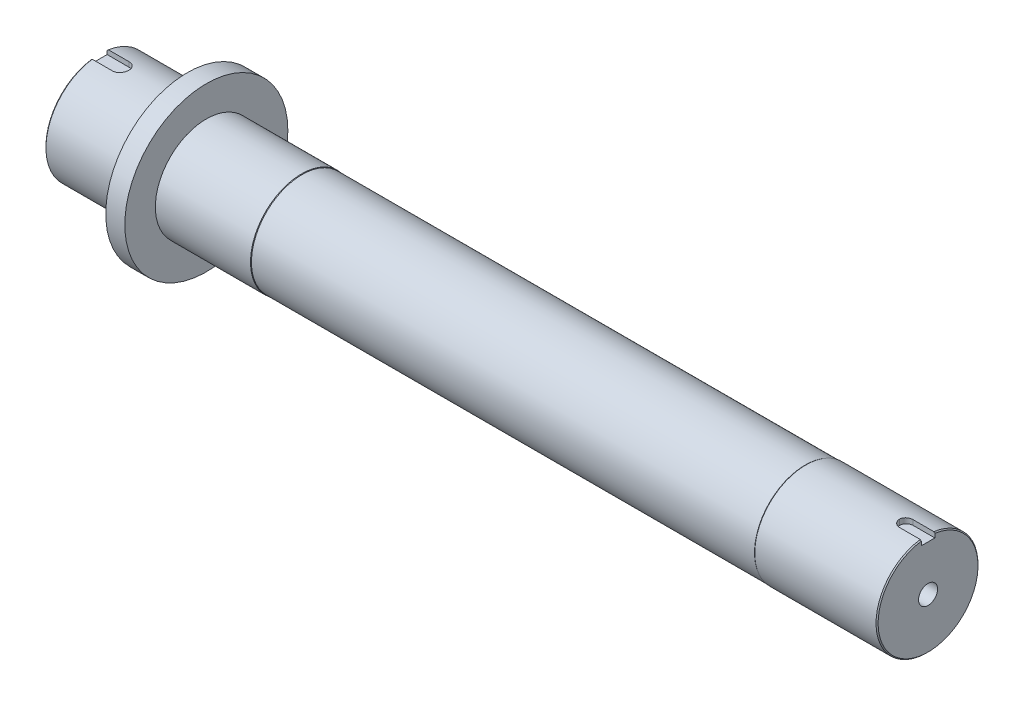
ISO-10303-21;
HEADER;
FILE_DESCRIPTION(('STEP AP214'),'2;1');
FILE_NAME('part.step','',(''),(''),'','','');
FILE_SCHEMA(('AUTOMOTIVE_DESIGN { 1 0 10303 214 1 1 1 1 }'));
ENDSEC;
DATA;
#1=APPLICATION_CONTEXT('core data for automotive mechanical design processes');
#2=APPLICATION_PROTOCOL_DEFINITION('international standard','automotive_design',2000,#1);
#3=PRODUCT_CONTEXT('',#1,'mechanical');
#4=PRODUCT('Part','Part','',(#3));
#5=PRODUCT_RELATED_PRODUCT_CATEGORY('part','',(#4));
#6=PRODUCT_DEFINITION_FORMATION('','',#4);
#7=PRODUCT_DEFINITION_CONTEXT('part definition',#1,'design');
#8=PRODUCT_DEFINITION('design','',#6,#7);
#9=PRODUCT_DEFINITION_SHAPE('','',#8);
#10=(LENGTH_UNIT() NAMED_UNIT(*) SI_UNIT(.MILLI.,.METRE.));
#11=(NAMED_UNIT(*) PLANE_ANGLE_UNIT() SI_UNIT($,.RADIAN.));
#12=(NAMED_UNIT(*) SI_UNIT($,.STERADIAN.) SOLID_ANGLE_UNIT());
#13=UNCERTAINTY_MEASURE_WITH_UNIT(LENGTH_MEASURE(1.E-05),#10,'distance_accuracy_value','');
#14=(GEOMETRIC_REPRESENTATION_CONTEXT(3) GLOBAL_UNCERTAINTY_ASSIGNED_CONTEXT((#13)) GLOBAL_UNIT_ASSIGNED_CONTEXT((#10,
#11,#12)) REPRESENTATION_CONTEXT('',''));
#15=CARTESIAN_POINT('',(0.,0.,0.));
#16=DIRECTION('',(0.,0.,1.));
#17=DIRECTION('',(1.,0.,0.));
#18=AXIS2_PLACEMENT_3D('',#15,#16,#17);
#19=CARTESIAN_POINT('',(0.,40.,0.));
#20=DIRECTION('',(-1.,0.,0.));
#21=DIRECTION('',(0.,0.,1.));
#22=AXIS2_PLACEMENT_3D('',#19,#20,#21);
#23=PLANE('',#22);
#24=DIRECTION('',(0.,-1.,0.));
#25=VECTOR('',#24,1.);
#26=CARTESIAN_POINT('',(0.,40.,-6.00000000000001));
#27=LINE('',#26,#25);
#28=CARTESIAN_POINT('',(0.,38.5356977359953,-6.00000000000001));
#29=VERTEX_POINT('',#28);
#30=CARTESIAN_POINT('',(0.,36.,-6.00000000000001));
#31=VERTEX_POINT('',#30);
#32=EDGE_CURVE('E148',#29,#31,#27,.T.);
#33=ORIENTED_EDGE('',*,*,#32,.F.);
#34=CARTESIAN_POINT('',(0.,0.,0.));
#35=DIRECTION('',(-1.,0.,0.));
#36=DIRECTION('',(0.,0.,1.));
#37=AXIS2_PLACEMENT_3D('',#34,#35,#36);
#38=CIRCLE('',#37,38.9999999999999);
#39=CARTESIAN_POINT('',(0.,38.5356977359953,6.00000000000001));
#40=VERTEX_POINT('',#39);
#41=EDGE_CURVE('E50',#29,#40,#38,.T.);
#42=ORIENTED_EDGE('',*,*,#41,.T.);
#43=DIRECTION('',(0.,1.,0.));
#44=VECTOR('',#43,1.);
#45=CARTESIAN_POINT('',(0.,40.,6.00000000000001));
#46=LINE('',#45,#44);
#47=CARTESIAN_POINT('',(0.,36.,6.00000000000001));
#48=VERTEX_POINT('',#47);
#49=EDGE_CURVE('E153',#48,#40,#46,.T.);
#50=ORIENTED_EDGE('',*,*,#49,.F.);
#51=DIRECTION('',(0.,0.,1.));
#52=VECTOR('',#51,1.);
#53=CARTESIAN_POINT('',(0.,36.,-6.00000000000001));
#54=LINE('',#53,#52);
#55=EDGE_CURVE('E150',#31,#48,#54,.T.);
#56=ORIENTED_EDGE('',*,*,#55,.F.);
#57=EDGE_LOOP('',(#33,#42,#50,#56));
#58=FACE_BOUND('',#57,.T.);
#59=ADVANCED_FACE('F38',(#58),#23,.T.);
#60=CARTESIAN_POINT('',(0.,0.,0.));
#61=DIRECTION('',(1.,0.,0.));
#62=DIRECTION('',(0.,0.,-1.));
#63=AXIS2_PLACEMENT_3D('',#60,#61,#62);
#64=CYLINDRICAL_SURFACE('',#63,40.);
#65=DIRECTION('',(1.,0.,0.));
#66=VECTOR('',#65,1.);
#67=CARTESIAN_POINT('',(0.,39.5474398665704,6.00000000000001));
#68=LINE('',#67,#66);
#69=CARTESIAN_POINT('',(1.00000000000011,39.5474398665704,6.00000000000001));
#70=VERTEX_POINT('',#69);
#71=CARTESIAN_POINT('',(16.,39.5474398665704,6.00000000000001));
#72=VERTEX_POINT('',#71);
#73=EDGE_CURVE('E365',#70,#72,#68,.T.);
#74=ORIENTED_EDGE('',*,*,#73,.F.);
#75=CARTESIAN_POINT('',(1.00000000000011,0.,0.));
#76=DIRECTION('',(-1.,0.,0.));
#77=DIRECTION('',(0.,0.,1.));
#78=AXIS2_PLACEMENT_3D('',#75,#76,#77);
#79=CIRCLE('',#78,40.);
#80=CARTESIAN_POINT('',(1.00000000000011,39.5474398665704,-6.00000000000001));
#81=VERTEX_POINT('',#80);
#82=EDGE_CURVE('E311',#70,#81,#79,.F.);
#83=ORIENTED_EDGE('',*,*,#82,.T.);
#84=DIRECTION('',(1.,0.,0.));
#85=VECTOR('',#84,1.);
#86=CARTESIAN_POINT('',(0.,39.5474398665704,-6.00000000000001));
#87=LINE('',#86,#85);
#88=CARTESIAN_POINT('',(16.,39.5474398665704,-6.00000000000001));
#89=VERTEX_POINT('',#88);
#90=EDGE_CURVE('E370',#89,#81,#87,.F.);
#91=ORIENTED_EDGE('',*,*,#90,.F.);
#92=CARTESIAN_POINT('',(16.,39.5474398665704,-6.00000000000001));
#93=CARTESIAN_POINT('',(16.1677459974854,39.5474288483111,-6.00001919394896));
#94=CARTESIAN_POINT('',(16.3354879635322,39.5485067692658,-5.99296614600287));
#95=CARTESIAN_POINT('',(16.6697528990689,39.5527606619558,-5.96485517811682));
#96=CARTESIAN_POINT('',(16.836275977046,39.555936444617,-5.94379852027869));
#97=CARTESIAN_POINT('',(17.1667210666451,39.5643011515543,-5.88785406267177));
#98=CARTESIAN_POINT('',(17.3306460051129,39.5694876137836,-5.85298317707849));
#99=CARTESIAN_POINT('',(17.6549401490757,39.5817203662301,-5.76967896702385));
#100=CARTESIAN_POINT('',(17.8153093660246,39.5887666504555,-5.72124568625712));
#101=CARTESIAN_POINT('',(18.1313799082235,39.6045181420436,-5.61116993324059));
#102=CARTESIAN_POINT('',(18.2870808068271,39.6132235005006,-5.54952625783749));
#103=CARTESIAN_POINT('',(18.5927731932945,39.6320474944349,-5.41345805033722));
#104=CARTESIAN_POINT('',(18.742762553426,39.642166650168,-5.33902881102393));
#105=CARTESIAN_POINT('',(19.0358834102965,39.663525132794,-5.17796937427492));
#106=CARTESIAN_POINT('',(19.179017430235,39.6747640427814,-5.09134371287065));
#107=CARTESIAN_POINT('',(19.45755833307,39.6980533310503,-4.90644915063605));
#108=CARTESIAN_POINT('',(19.5929624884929,39.7101039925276,-4.80817617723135));
#109=CARTESIAN_POINT('',(19.8559676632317,39.7347609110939,-4.59998203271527));
#110=CARTESIAN_POINT('',(19.9835088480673,39.7473704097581,-4.48998565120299));
#111=CARTESIAN_POINT('',(20.2288907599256,39.7727120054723,-4.25967106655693));
#112=CARTESIAN_POINT('',(20.3467314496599,39.7854441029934,-4.13935282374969));
#113=CARTESIAN_POINT('',(20.5719379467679,39.8106780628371,-3.88917980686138));
#114=CARTESIAN_POINT('',(20.6792999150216,39.8231798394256,-3.75932156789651));
#115=CARTESIAN_POINT('',(20.882714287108,39.8475934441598,-3.491049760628));
#116=CARTESIAN_POINT('',(20.9787706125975,39.8595054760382,-3.35263918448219));
#117=CARTESIAN_POINT('',(21.1594257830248,39.8824723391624,-3.06740557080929));
#118=CARTESIAN_POINT('',(21.2439597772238,39.8935221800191,-2.92054104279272));
#119=CARTESIAN_POINT('',(21.40030861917,39.9143749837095,-2.62017644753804));
#120=CARTESIAN_POINT('',(21.4721281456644,39.9241784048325,-2.46667884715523));
#121=CARTESIAN_POINT('',(21.6025342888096,39.9422610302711,-2.15412757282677));
#122=CARTESIAN_POINT('',(21.6611253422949,39.9505407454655,-1.99507578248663));
#123=CARTESIAN_POINT('',(21.7646494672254,39.9653420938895,-1.67257605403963));
#124=CARTESIAN_POINT('',(21.8095858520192,39.9718641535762,-1.50912919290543));
#125=CARTESIAN_POINT('',(21.8981440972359,39.9848163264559,-1.12378184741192));
#126=CARTESIAN_POINT('',(21.9363286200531,39.9904902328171,-0.900567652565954));
#127=CARTESIAN_POINT('',(21.9745217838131,39.996184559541,-0.563799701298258));
#128=CARTESIAN_POINT('',(21.9840722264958,39.9976132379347,-0.451261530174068));
#129=CARTESIAN_POINT('',(21.9968105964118,39.9995214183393,-0.225825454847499));
#130=CARTESIAN_POINT('',(21.999998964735,40.000000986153,-0.11292757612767));
#131=CARTESIAN_POINT('',(22.,40.,0.));
#132=B_SPLINE_CURVE_WITH_KNOTS('',3,(#92,#93,#94,#95,#96,#97,#98,#99,#100,#101,#102,#103,#104,
#105,#106,#107,#108,#109,#110,#111,#112,#113,#114,#115,#116,#117,#118,#119,#120,#121,#122,#123,
#124,#125,#126,#127,#128,#129,#130,#131),.UNSPECIFIED.,.F.,.F.,(4,2,2,2,2,2,2,2,2,2,2,2,2,2,2,2,
2,2,2,4),(0.,0.503080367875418,1.00611540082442,1.50853641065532,2.01095580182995,
2.51342097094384,3.01607152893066,3.51853563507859,4.0211759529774,4.52726089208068,
5.0333477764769,5.5396193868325,6.04571486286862,6.55455051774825,7.06319853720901,
7.57167570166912,8.08002938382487,8.75793555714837,9.09663656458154,9.4353140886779),.UNSPECIFIED.);
#133=CARTESIAN_POINT('',(22.,40.,0.));
#134=VERTEX_POINT('',#133);
#135=EDGE_CURVE('E272',#89,#134,#132,.T.);
#136=ORIENTED_EDGE('',*,*,#135,.T.);
#137=CARTESIAN_POINT('',(22.,40.,0.));
#138=CARTESIAN_POINT('',(22.0000191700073,40.0000105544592,0.167756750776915));
#139=CARTESIAN_POINT('',(21.9929652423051,39.9989450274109,0.33550953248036));
#140=CARTESIAN_POINT('',(21.964850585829,39.9947382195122,0.669796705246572));
#141=CARTESIAN_POINT('',(21.9437910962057,39.9915971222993,0.836331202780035));
#142=CARTESIAN_POINT('',(21.8878385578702,39.9833205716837,1.16680127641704));
#143=CARTESIAN_POINT('',(21.8529622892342,39.9781875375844,1.33073975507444));
#144=CARTESIAN_POINT('',(21.7696446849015,39.9660742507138,1.65506116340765));
#145=CARTESIAN_POINT('',(21.7212033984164,39.9590940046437,1.81544410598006));
#146=CARTESIAN_POINT('',(21.6111084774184,39.9434797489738,2.13154304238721));
#147=CARTESIAN_POINT('',(21.5494535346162,39.934845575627,2.28725857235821));
#148=CARTESIAN_POINT('',(21.4133600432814,39.9161611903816,2.59297896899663));
#149=CARTESIAN_POINT('',(21.3389167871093,39.9061104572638,2.74298170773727));
#150=CARTESIAN_POINT('',(21.1778274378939,39.884878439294,3.03612643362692));
#151=CARTESIAN_POINT('',(21.0911859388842,39.8736975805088,3.17927097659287));
#152=CARTESIAN_POINT('',(20.906258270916,39.8505075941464,3.45782999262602));
#153=CARTESIAN_POINT('',(20.8079680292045,39.8384981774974,3.59324173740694));
#154=CARTESIAN_POINT('',(20.5997566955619,39.8139046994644,3.85623587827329));
#155=CARTESIAN_POINT('',(20.4897623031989,39.8013173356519,3.98375993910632));
#156=CARTESIAN_POINT('',(20.2594552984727,39.7759960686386,4.22910748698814));
#157=CARTESIAN_POINT('',(20.1391426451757,39.7632621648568,4.34693093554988));
#158=CARTESIAN_POINT('',(19.8889840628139,39.73800083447,4.57210385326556));
#159=CARTESIAN_POINT('',(19.7591346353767,39.7254734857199,4.67944944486));
#160=CARTESIAN_POINT('',(19.4908837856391,39.7009878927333,4.88283233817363));
#161=CARTESIAN_POINT('',(19.3524853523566,39.6890294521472,4.97887355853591));
#162=CARTESIAN_POINT('',(19.0672611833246,39.66595240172,5.15951168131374));
#163=CARTESIAN_POINT('',(18.9203930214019,39.6548388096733,5.24404225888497));
#164=CARTESIAN_POINT('',(18.6200214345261,39.6338501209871,5.40038387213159));
#165=CARTESIAN_POINT('',(18.4665204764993,39.6239745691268,5.47219958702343));
#166=CARTESIAN_POINT('',(18.1539627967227,39.6057475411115,5.60259767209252));
#167=CARTESIAN_POINT('',(17.9949079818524,39.5973955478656,5.6611845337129));
#168=CARTESIAN_POINT('',(17.672401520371,39.5824576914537,5.76470015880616));
#169=CARTESIAN_POINT('',(17.5089509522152,39.575871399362,5.80963223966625));
#170=CARTESIAN_POINT('',(17.1236306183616,39.5627887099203,5.89817162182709));
#171=CARTESIAN_POINT('',(16.9004478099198,39.5570539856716,5.93634558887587));
#172=CARTESIAN_POINT('',(16.5637259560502,39.5512976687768,5.97452845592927));
#173=CARTESIAN_POINT('',(16.4512025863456,39.5498532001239,5.98407638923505));
#174=CARTESIAN_POINT('',(16.225796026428,39.5479238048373,5.99681142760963));
#175=CARTESIAN_POINT('',(16.1129128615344,39.5474388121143,5.99999897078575));
#176=CARTESIAN_POINT('',(16.,39.5474398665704,6.00000000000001));
#177=B_SPLINE_CURVE_WITH_KNOTS('',3,(#137,#138,#139,#140,#141,#142,#143,#144,#145,#146,#147,
#148,#149,#150,#151,#152,#153,#154,#155,#156,#157,#158,#159,#160,#161,#162,#163,#164,#165,#166,
#167,#168,#169,#170,#171,#172,#173,#174,#175,#176),.UNSPECIFIED.,.F.,.F.,(4,2,2,2,2,2,2,2,2,2,2,
2,2,2,2,2,2,2,2,4),(0.,0.503112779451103,1.0061810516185,1.50864022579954,2.01109757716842,
2.51360470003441,3.01629720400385,3.51880089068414,4.02148078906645,4.52751821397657,
5.03355764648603,5.53978364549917,6.04583364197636,6.55468617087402,7.06335104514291,
7.57184295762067,8.08021123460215,8.75802402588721,9.09668073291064,9.4353141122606),.UNSPECIFIED.);
#178=EDGE_CURVE('E279',#134,#72,#177,.T.);
#179=ORIENTED_EDGE('',*,*,#178,.T.);
#180=EDGE_LOOP('',(#74,#83,#91,#136,#179));
#181=FACE_BOUND('',#180,.T.);
#182=CARTESIAN_POINT('',(65.,0.,0.));
#183=DIRECTION('',(1.,0.,0.));
#184=DIRECTION('',(0.,0.,-1.));
#185=AXIS2_PLACEMENT_3D('',#182,#183,#184);
#186=CIRCLE('',#185,40.);
#187=CARTESIAN_POINT('',(65.,0.,-40.));
#188=VERTEX_POINT('',#187);
#189=EDGE_CURVE('E200',#188,#188,#186,.T.);
#190=ORIENTED_EDGE('',*,*,#189,.F.);
#191=EDGE_LOOP('',(#190));
#192=FACE_BOUND('',#191,.T.);
#193=ADVANCED_FACE('F265',(#181,#192),#64,.T.);
#194=CARTESIAN_POINT('',(65.,60.0000000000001,0.));
#195=DIRECTION('',(-1.,0.,0.));
#196=DIRECTION('',(0.,0.,1.));
#197=AXIS2_PLACEMENT_3D('',#194,#195,#196);
#198=PLANE('',#197);
#199=ORIENTED_EDGE('',*,*,#189,.T.);
#200=EDGE_LOOP('',(#199));
#201=FACE_BOUND('',#200,.T.);
#202=CARTESIAN_POINT('',(65.,0.,0.));
#203=DIRECTION('',(1.,0.,0.));
#204=DIRECTION('',(0.,0.,-1.));
#205=AXIS2_PLACEMENT_3D('',#202,#203,#204);
#206=CIRCLE('',#205,60.);
#207=CARTESIAN_POINT('',(65.,0.,-60.0000000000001));
#208=VERTEX_POINT('',#207);
#209=EDGE_CURVE('E197',#208,#208,#206,.T.);
#210=ORIENTED_EDGE('',*,*,#209,.F.);
#211=EDGE_LOOP('',(#210));
#212=FACE_BOUND('',#211,.T.);
#213=ADVANCED_FACE('F262',(#201,#212),#198,.T.);
#214=CARTESIAN_POINT('',(0.,0.,0.));
#215=DIRECTION('',(1.,0.,0.));
#216=DIRECTION('',(0.,0.,-1.));
#217=AXIS2_PLACEMENT_3D('',#214,#215,#216);
#218=CYLINDRICAL_SURFACE('',#217,60.);
#219=ORIENTED_EDGE('',*,*,#209,.T.);
#220=EDGE_LOOP('',(#219));
#221=FACE_BOUND('',#220,.T.);
#222=CARTESIAN_POINT('',(79.,0.,0.));
#223=DIRECTION('',(1.,0.,0.));
#224=DIRECTION('',(0.,0.,-1.));
#225=AXIS2_PLACEMENT_3D('',#222,#223,#224);
#226=CIRCLE('',#225,60.);
#227=CARTESIAN_POINT('',(79.,0.,-60.0000000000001));
#228=VERTEX_POINT('',#227);
#229=EDGE_CURVE('E194',#228,#228,#226,.T.);
#230=ORIENTED_EDGE('',*,*,#229,.F.);
#231=EDGE_LOOP('',(#230));
#232=FACE_BOUND('',#231,.T.);
#233=ADVANCED_FACE('F258',(#221,#232),#218,.T.);
#234=CARTESIAN_POINT('',(79.,60.0000000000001,0.));
#235=DIRECTION('',(1.,0.,0.));
#236=DIRECTION('',(0.,0.,-1.));
#237=AXIS2_PLACEMENT_3D('',#234,#235,#236);
#238=PLANE('',#237);
#239=ORIENTED_EDGE('',*,*,#229,.T.);
#240=EDGE_LOOP('',(#239));
#241=FACE_BOUND('',#240,.T.);
#242=CARTESIAN_POINT('',(79.,0.,0.));
#243=DIRECTION('',(1.,0.,0.));
#244=DIRECTION('',(0.,0.,-1.));
#245=AXIS2_PLACEMENT_3D('',#242,#243,#244);
#246=CIRCLE('',#245,37.5);
#247=CARTESIAN_POINT('',(79.,0.,-37.5));
#248=VERTEX_POINT('',#247);
#249=EDGE_CURVE('E191',#248,#248,#246,.T.);
#250=ORIENTED_EDGE('',*,*,#249,.F.);
#251=EDGE_LOOP('',(#250));
#252=FACE_BOUND('',#251,.T.);
#253=ADVANCED_FACE('F254',(#241,#252),#238,.T.);
#254=CARTESIAN_POINT('',(0.,0.,0.));
#255=DIRECTION('',(1.,0.,0.));
#256=DIRECTION('',(0.,0.,-1.));
#257=AXIS2_PLACEMENT_3D('',#254,#255,#256);
#258=CYLINDRICAL_SURFACE('',#257,37.5);
#259=ORIENTED_EDGE('',*,*,#249,.T.);
#260=EDGE_LOOP('',(#259));
#261=FACE_BOUND('',#260,.T.);
#262=CARTESIAN_POINT('',(149.,0.,0.));
#263=DIRECTION('',(1.,0.,0.));
#264=DIRECTION('',(0.,0.,-1.));
#265=AXIS2_PLACEMENT_3D('',#262,#263,#264);
#266=CIRCLE('',#265,37.5);
#267=CARTESIAN_POINT('',(149.,0.,-37.5));
#268=VERTEX_POINT('',#267);
#269=EDGE_CURVE('E188',#268,#268,#266,.T.);
#270=ORIENTED_EDGE('',*,*,#269,.F.);
#271=EDGE_LOOP('',(#270));
#272=FACE_BOUND('',#271,.T.);
#273=ADVANCED_FACE('F250',(#261,#272),#258,.T.);
#274=CARTESIAN_POINT('',(149.433012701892,0.,0.));
#275=DIRECTION('',(-1.,0.,0.));
#276=DIRECTION('',(0.,0.,1.));
#277=AXIS2_PLACEMENT_3D('',#274,#275,#276);
#278=CONICAL_SURFACE('',#277,37.25,0.523598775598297);
#279=ORIENTED_EDGE('',*,*,#269,.T.);
#280=EDGE_LOOP('',(#279));
#281=FACE_BOUND('',#280,.T.);
#282=CARTESIAN_POINT('',(149.433012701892,0.,0.));
#283=DIRECTION('',(1.,0.,0.));
#284=DIRECTION('',(0.,0.,-1.));
#285=AXIS2_PLACEMENT_3D('',#282,#283,#284);
#286=CIRCLE('',#285,37.25);
#287=CARTESIAN_POINT('',(149.433012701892,0.,-37.25));
#288=VERTEX_POINT('',#287);
#289=EDGE_CURVE('E185',#288,#288,#286,.T.);
#290=ORIENTED_EDGE('',*,*,#289,.F.);
#291=EDGE_LOOP('',(#290));
#292=FACE_BOUND('',#291,.T.);
#293=ADVANCED_FACE('F246',(#281,#292),#278,.T.);
#294=CARTESIAN_POINT('',(0.,0.,0.));
#295=DIRECTION('',(1.,0.,0.));
#296=DIRECTION('',(0.,0.,-1.));
#297=AXIS2_PLACEMENT_3D('',#294,#295,#296);
#298=CYLINDRICAL_SURFACE('',#297,37.25);
#299=ORIENTED_EDGE('',*,*,#289,.T.);
#300=EDGE_LOOP('',(#299));
#301=FACE_BOUND('',#300,.T.);
#302=CARTESIAN_POINT('',(519.566987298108,0.,0.));
#303=DIRECTION('',(1.,0.,0.));
#304=DIRECTION('',(0.,0.,-1.));
#305=AXIS2_PLACEMENT_3D('',#302,#303,#304);
#306=CIRCLE('',#305,37.25);
#307=CARTESIAN_POINT('',(519.566987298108,0.,-37.25));
#308=VERTEX_POINT('',#307);
#309=EDGE_CURVE('E182',#308,#308,#306,.T.);
#310=ORIENTED_EDGE('',*,*,#309,.F.);
#311=EDGE_LOOP('',(#310));
#312=FACE_BOUND('',#311,.T.);
#313=ADVANCED_FACE('F242',(#301,#312),#298,.T.);
#314=CARTESIAN_POINT('',(520.,0.,0.));
#315=DIRECTION('',(1.,0.,0.));
#316=DIRECTION('',(0.,0.,-1.));
#317=AXIS2_PLACEMENT_3D('',#314,#315,#316);
#318=CONICAL_SURFACE('',#317,37.5,0.523598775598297);
#319=ORIENTED_EDGE('',*,*,#309,.T.);
#320=EDGE_LOOP('',(#319));
#321=FACE_BOUND('',#320,.T.);
#322=CARTESIAN_POINT('',(520.,0.,0.));
#323=DIRECTION('',(1.,0.,0.));
#324=DIRECTION('',(0.,0.,-1.));
#325=AXIS2_PLACEMENT_3D('',#322,#323,#324);
#326=CIRCLE('',#325,37.5);
#327=CARTESIAN_POINT('',(520.,0.,-37.5));
#328=VERTEX_POINT('',#327);
#329=EDGE_CURVE('E179',#328,#328,#326,.T.);
#330=ORIENTED_EDGE('',*,*,#329,.F.);
#331=EDGE_LOOP('',(#330));
#332=FACE_BOUND('',#331,.T.);
#333=ADVANCED_FACE('F236',(#321,#332),#318,.T.);
#334=CARTESIAN_POINT('',(0.,0.,0.));
#335=DIRECTION('',(1.,0.,0.));
#336=DIRECTION('',(0.,0.,-1.));
#337=AXIS2_PLACEMENT_3D('',#334,#335,#336);
#338=CYLINDRICAL_SURFACE('',#337,37.5);
#339=DIRECTION('',(1.,0.,0.));
#340=VECTOR('',#339,1.);
#341=CARTESIAN_POINT('',(0.,37.1651718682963,-5.));
#342=LINE('',#341,#340);
#343=CARTESIAN_POINT('',(609.25,37.1651718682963,-5.));
#344=VERTEX_POINT('',#343);
#345=CARTESIAN_POINT('',(594.,37.1651718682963,-5.));
#346=VERTEX_POINT('',#345);
#347=EDGE_CURVE('E172',#344,#346,#342,.F.);
#348=ORIENTED_EDGE('',*,*,#347,.F.);
#349=CARTESIAN_POINT('',(609.25,0.,0.));
#350=DIRECTION('',(1.,0.,0.));
#351=DIRECTION('',(0.,0.,-1.));
#352=AXIS2_PLACEMENT_3D('',#349,#350,#351);
#353=CIRCLE('',#352,37.5);
#354=CARTESIAN_POINT('',(609.25,37.1651718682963,5.));
#355=VERTEX_POINT('',#354);
#356=EDGE_CURVE('E334',#344,#355,#353,.F.);
#357=ORIENTED_EDGE('',*,*,#356,.T.);
#358=DIRECTION('',(1.,0.,0.));
#359=VECTOR('',#358,1.);
#360=CARTESIAN_POINT('',(0.,37.1651718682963,5.));
#361=LINE('',#360,#359);
#362=CARTESIAN_POINT('',(594.,37.1651718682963,5.));
#363=VERTEX_POINT('',#362);
#364=EDGE_CURVE('E176',#363,#355,#361,.T.);
#365=ORIENTED_EDGE('',*,*,#364,.F.);
#366=CARTESIAN_POINT('',(594.,37.1651718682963,5.));
#367=CARTESIAN_POINT('',(593.860034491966,37.1651637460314,5.00001581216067));
#368=CARTESIAN_POINT('',(593.720072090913,37.1659622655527,4.99412357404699));
#369=CARTESIAN_POINT('',(593.441161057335,37.1691137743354,4.97063784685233));
#370=CARTESIAN_POINT('',(593.302212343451,37.1714666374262,4.953045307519));
#371=CARTESIAN_POINT('',(593.026468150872,37.1776645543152,4.90630006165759));
#372=CARTESIAN_POINT('',(592.889670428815,37.1815079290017,4.87716036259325));
#373=CARTESIAN_POINT('',(592.619039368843,37.1905737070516,4.80754268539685));
#374=CARTESIAN_POINT('',(592.485206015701,37.19579610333,4.7670647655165));
#375=CARTESIAN_POINT('',(592.221427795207,37.2074717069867,4.6750610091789));
#376=CARTESIAN_POINT('',(592.091483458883,37.213925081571,4.62353367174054));
#377=CARTESIAN_POINT('',(591.836362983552,37.2278806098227,4.50978803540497));
#378=CARTESIAN_POINT('',(591.711188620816,37.2353831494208,4.4475658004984));
#379=CARTESIAN_POINT('',(591.466576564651,37.251219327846,4.31291657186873));
#380=CARTESIAN_POINT('',(591.34713656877,37.2595526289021,4.2404937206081));
#381=CARTESIAN_POINT('',(591.114721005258,37.2768211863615,4.08590877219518));
#382=CARTESIAN_POINT('',(591.001747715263,37.2857566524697,4.00374327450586));
#383=CARTESIAN_POINT('',(590.78249844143,37.3040254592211,3.82980028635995));
#384=CARTESIAN_POINT('',(590.676261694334,37.3133606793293,3.73797353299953));
#385=CARTESIAN_POINT('',(590.471888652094,37.3321203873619,3.54571758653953));
#386=CARTESIAN_POINT('',(590.373752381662,37.3415448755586,3.44528836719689));
#387=CARTESIAN_POINT('',(590.186229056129,37.3602213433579,3.23648713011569));
#388=CARTESIAN_POINT('',(590.096845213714,37.3694732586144,3.12811222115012));
#389=CARTESIAN_POINT('',(589.92752411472,37.3875376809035,2.90424348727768));
#390=CARTESIAN_POINT('',(589.847583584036,37.3963503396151,2.78875215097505));
#391=CARTESIAN_POINT('',(589.697350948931,37.4133290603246,2.55089842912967));
#392=CARTESIAN_POINT('',(589.627102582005,37.4214921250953,2.42850819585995));
#393=CARTESIAN_POINT('',(589.497202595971,37.4368939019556,2.17823050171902));
#394=CARTESIAN_POINT('',(589.437547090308,37.4441329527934,2.05034507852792));
#395=CARTESIAN_POINT('',(589.329255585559,37.4574820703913,1.78997615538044));
#396=CARTESIAN_POINT('',(589.280616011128,37.4635925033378,1.65749416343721));
#397=CARTESIAN_POINT('',(589.194705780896,37.4745119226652,1.38889796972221));
#398=CARTESIAN_POINT('',(589.157432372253,37.4793212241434,1.25278465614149));
#399=CARTESIAN_POINT('',(589.084151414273,37.4888490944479,0.932495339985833));
#400=CARTESIAN_POINT('',(589.052602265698,37.4930163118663,0.747251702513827));
#401=CARTESIAN_POINT('',(589.021047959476,37.4971982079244,0.467798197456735));
#402=CARTESIAN_POINT('',(589.013158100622,37.4982473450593,0.374420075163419));
#403=CARTESIAN_POINT('',(589.002634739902,37.4996485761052,0.187369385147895));
#404=CARTESIAN_POINT('',(589.000000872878,37.5000007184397,0.093696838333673));
#405=CARTESIAN_POINT('',(589.,37.5,0.));
#406=B_SPLINE_CURVE_WITH_KNOTS('',3,(#366,#367,#368,#369,#370,#371,#372,#373,#374,#375,#376,
#377,#378,#379,#380,#381,#382,#383,#384,#385,#386,#387,#388,#389,#390,#391,#392,#393,#394,#395,
#396,#397,#398,#399,#400,#401,#402,#403,#404,#405),.UNSPECIFIED.,.F.,.F.,(4,2,2,2,2,2,2,2,2,2,2,
2,2,2,2,2,2,2,2,4),(0.,0.419765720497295,0.839497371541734,1.25875754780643,1.67801557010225,
2.09733058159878,2.51680024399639,2.93610004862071,3.35554663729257,3.77724641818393,
4.1989474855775,4.6208027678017,5.04251135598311,5.46606473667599,5.88946239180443,
6.31272243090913,6.73587987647,7.29837784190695,7.57940178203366,7.8604061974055),.UNSPECIFIED.);
#407=CARTESIAN_POINT('',(589.,37.5,0.));
#408=VERTEX_POINT('',#407);
#409=EDGE_CURVE('E214',#363,#408,#406,.T.);
#410=ORIENTED_EDGE('',*,*,#409,.T.);
#411=CARTESIAN_POINT('',(589.,37.5,0.));
#412=CARTESIAN_POINT('',(588.999984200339,37.5000078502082,-0.13997111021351));
#413=CARTESIAN_POINT('',(589.005876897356,37.4992165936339,-0.279939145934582));
#414=CARTESIAN_POINT('',(589.029364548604,37.4960926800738,-0.558861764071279));
#415=CARTESIAN_POINT('',(589.046958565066,37.4937601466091,-0.697816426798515));
#416=CARTESIAN_POINT('',(589.093708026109,37.4876139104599,-0.973573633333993));
#417=CARTESIAN_POINT('',(589.122850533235,37.4838018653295,-1.11037840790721));
#418=CARTESIAN_POINT('',(589.192475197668,37.4748061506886,-1.38102366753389));
#419=CARTESIAN_POINT('',(589.232957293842,37.4696224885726,-1.51486416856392));
#420=CARTESIAN_POINT('',(589.324971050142,37.458027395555,-1.77865717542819));
#421=CARTESIAN_POINT('',(589.376504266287,37.4516157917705,-1.90860913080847));
#422=CARTESIAN_POINT('',(589.490263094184,37.4377421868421,-2.16374418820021));
#423=CARTESIAN_POINT('',(589.552492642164,37.4302797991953,-2.28892551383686));
#424=CARTESIAN_POINT('',(589.687157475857,37.4145178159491,-2.53354998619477));
#425=CARTESIAN_POINT('',(589.7595885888,37.4062185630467,-2.65299545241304));
#426=CARTESIAN_POINT('',(589.914190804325,37.3890082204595,-2.88542042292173));
#427=CARTESIAN_POINT('',(589.996365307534,37.3800969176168,-2.99839764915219));
#428=CARTESIAN_POINT('',(590.170317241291,37.3618649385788,-3.21764114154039));
#429=CARTESIAN_POINT('',(590.262142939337,37.3525423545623,-3.32386895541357));
#430=CARTESIAN_POINT('',(590.454394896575,37.3337938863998,-3.52822407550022));
#431=CARTESIAN_POINT('',(590.554821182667,37.3243680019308,-3.62635135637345));
#432=CARTESIAN_POINT('',(590.763614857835,37.3056748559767,-3.81385717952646));
#433=CARTESIAN_POINT('',(590.871985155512,37.2964076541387,-3.90323248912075));
#434=CARTESIAN_POINT('',(591.095842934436,37.2783005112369,-4.07253719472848));
#435=CARTESIAN_POINT('',(591.211327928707,37.26946042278,-4.15246986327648));
#436=CARTESIAN_POINT('',(591.449176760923,37.2524169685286,-4.3026936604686));
#437=CARTESIAN_POINT('',(591.571568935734,37.2442166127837,-4.37294027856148));
#438=CARTESIAN_POINT('',(591.821850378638,37.2287354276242,-4.5028365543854));
#439=CARTESIAN_POINT('',(591.949737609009,37.2214542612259,-4.56249009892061));
#440=CARTESIAN_POINT('',(592.210109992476,37.2080208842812,-4.67077744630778));
#441=CARTESIAN_POINT('',(592.342593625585,37.2018683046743,-4.71941485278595));
#442=CARTESIAN_POINT('',(592.611193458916,37.1908693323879,-4.80532067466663));
#443=CARTESIAN_POINT('',(592.747308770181,37.1860226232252,-4.84259184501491));
#444=CARTESIAN_POINT('',(593.067583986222,37.176418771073,-4.91586296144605));
#445=CARTESIAN_POINT('',(593.252811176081,37.1722161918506,-4.94740659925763));
#446=CARTESIAN_POINT('',(593.532240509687,37.1679982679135,-4.97895552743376));
#447=CARTESIAN_POINT('',(593.625610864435,37.166939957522,-4.98684407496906));
#448=CARTESIAN_POINT('',(593.812646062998,37.1655264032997,-4.99736569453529));
#449=CARTESIAN_POINT('',(593.906310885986,37.1651711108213,-4.99999913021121));
#450=CARTESIAN_POINT('',(594.,37.1651718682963,-5.00000000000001));
#451=B_SPLINE_CURVE_WITH_KNOTS('',3,(#411,#412,#413,#414,#415,#416,#417,#418,#419,#420,#421,
#422,#423,#424,#425,#426,#427,#428,#429,#430,#431,#432,#433,#434,#435,#436,#437,#438,#439,#440,
#441,#442,#443,#444,#445,#446,#447,#448,#449,#450),.UNSPECIFIED.,.F.,.F.,(4,2,2,2,2,2,2,2,2,2,2,
2,2,2,2,2,2,2,2,4),(0.,0.41978260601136,0.839531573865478,1.2588116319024,1.67808942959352,
2.09742630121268,2.51691781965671,2.93623824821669,3.35570546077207,3.77738049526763,
4.19905684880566,4.62088837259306,5.0425732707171,5.46613559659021,5.88954218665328,
6.31281007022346,6.73597528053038,7.29842427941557,7.57942496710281,7.86040620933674),.UNSPECIFIED.);
#452=EDGE_CURVE('E221',#408,#346,#451,.T.);
#453=ORIENTED_EDGE('',*,*,#452,.T.);
#454=EDGE_LOOP('',(#348,#357,#365,#410,#453));
#455=FACE_BOUND('',#454,.T.);
#456=ORIENTED_EDGE('',*,*,#329,.T.);
#457=EDGE_LOOP('',(#456));
#458=FACE_BOUND('',#457,.T.);
#459=ADVANCED_FACE('F230',(#455,#458),#338,.T.);
#460=CARTESIAN_POINT('',(610.,37.5,0.));
#461=DIRECTION('',(1.,0.,0.));
#462=DIRECTION('',(0.,0.,-1.));
#463=AXIS2_PLACEMENT_3D('',#460,#461,#462);
#464=PLANE('',#463);
#465=CARTESIAN_POINT('',(610.,0.,0.));
#466=DIRECTION('',(1.,0.,0.));
#467=DIRECTION('',(0.,0.,-1.));
#468=AXIS2_PLACEMENT_3D('',#465,#466,#467);
#469=CIRCLE('',#468,6.99999999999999);
#470=CARTESIAN_POINT('',(610.,0.,-7.));
#471=VERTEX_POINT('',#470);
#472=EDGE_CURVE('E140',#471,#471,#469,.T.);
#473=ORIENTED_EDGE('',*,*,#472,.F.);
#474=EDGE_LOOP('',(#473));
#475=FACE_BOUND('',#474,.T.);
#476=DIRECTION('',(0.,-1.,0.));
#477=VECTOR('',#476,1.);
#478=CARTESIAN_POINT('',(610.,37.5,5.));
#479=LINE('',#478,#477);
#480=CARTESIAN_POINT('',(610.,36.4082751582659,5.));
#481=VERTEX_POINT('',#480);
#482=CARTESIAN_POINT('',(610.,33.5,5.));
#483=VERTEX_POINT('',#482);
#484=EDGE_CURVE('E203',#481,#483,#479,.T.);
#485=ORIENTED_EDGE('',*,*,#484,.F.);
#486=CARTESIAN_POINT('',(610.,0.,0.));
#487=DIRECTION('',(1.,0.,0.));
#488=DIRECTION('',(0.,0.,-1.));
#489=AXIS2_PLACEMENT_3D('',#486,#487,#488);
#490=CIRCLE('',#489,36.75);
#491=CARTESIAN_POINT('',(610.,36.4082751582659,-5.));
#492=VERTEX_POINT('',#491);
#493=EDGE_CURVE('E286',#481,#492,#490,.T.);
#494=ORIENTED_EDGE('',*,*,#493,.T.);
#495=DIRECTION('',(0.,1.,0.));
#496=VECTOR('',#495,1.);
#497=CARTESIAN_POINT('',(610.,37.5,-5.00000000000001));
#498=LINE('',#497,#496);
#499=CARTESIAN_POINT('',(610.,33.5,-5.));
#500=VERTEX_POINT('',#499);
#501=EDGE_CURVE('E166',#500,#492,#498,.T.);
#502=ORIENTED_EDGE('',*,*,#501,.F.);
#503=DIRECTION('',(0.,0.,-1.));
#504=VECTOR('',#503,1.);
#505=CARTESIAN_POINT('',(610.,33.5,5.));
#506=LINE('',#505,#504);
#507=EDGE_CURVE('E163',#483,#500,#506,.T.);
#508=ORIENTED_EDGE('',*,*,#507,.F.);
#509=EDGE_LOOP('',(#485,#494,#502,#508));
#510=FACE_BOUND('',#509,.T.);
#511=ADVANCED_FACE('F235',(#475,#510),#464,.T.);
#512=CARTESIAN_POINT('',(589.,37.5,5.));
#513=DIRECTION('',(0.,0.,1.));
#514=DIRECTION('',(0.,-1.,0.));
#515=AXIS2_PLACEMENT_3D('',#512,#513,#514);
#516=PLANE('',#515);
#517=ORIENTED_EDGE('',*,*,#364,.T.);
#518=CARTESIAN_POINT('',(609.25,37.1651718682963,5.));
#519=CARTESIAN_POINT('',(609.375011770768,37.0390340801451,5.));
#520=CARTESIAN_POINT('',(609.500017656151,36.912890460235,5.));
#521=CARTESIAN_POINT('',(609.750017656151,36.6605915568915,5.));
#522=CARTESIAN_POINT('',(609.875011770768,36.5344362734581,5.));
#523=CARTESIAN_POINT('',(610.,36.4082751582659,5.));
#524=B_SPLINE_CURVE_WITH_KNOTS('',3,(#518,#519,#520,#521,#522,#523),.UNSPECIFIED.,.F.,.F.,(4,2,
4),(0.,0.532774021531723,1.06554804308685),.UNSPECIFIED.);
#525=EDGE_CURVE('E330',#355,#481,#524,.T.);
#526=ORIENTED_EDGE('',*,*,#525,.T.);
#527=ORIENTED_EDGE('',*,*,#484,.T.);
#528=DIRECTION('',(1.,0.,0.));
#529=VECTOR('',#528,1.);
#530=CARTESIAN_POINT('',(589.,33.5,5.));
#531=LINE('',#530,#529);
#532=CARTESIAN_POINT('',(594.,33.5,5.));
#533=VERTEX_POINT('',#532);
#534=EDGE_CURVE('E169',#533,#483,#531,.T.);
#535=ORIENTED_EDGE('',*,*,#534,.F.);
#536=DIRECTION('',(0.,-1.,0.));
#537=VECTOR('',#536,1.);
#538=CARTESIAN_POINT('',(594.,37.5,5.));
#539=LINE('',#538,#537);
#540=EDGE_CURVE('E209',#533,#363,#539,.F.);
#541=ORIENTED_EDGE('',*,*,#540,.T.);
#542=EDGE_LOOP('',(#517,#526,#527,#535,#541));
#543=FACE_BOUND('',#542,.T.);
#544=ADVANCED_FACE('F335',(#543),#516,.F.);
#545=CARTESIAN_POINT('',(589.,37.5,-5.00000000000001));
#546=DIRECTION('',(0.,0.,-1.));
#547=DIRECTION('',(0.,1.,0.));
#548=AXIS2_PLACEMENT_3D('',#545,#546,#547);
#549=PLANE('',#548);
#550=ORIENTED_EDGE('',*,*,#501,.T.);
#551=CARTESIAN_POINT('',(610.,36.4082751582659,-5.));
#552=CARTESIAN_POINT('',(609.875011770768,36.5344362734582,-5.));
#553=CARTESIAN_POINT('',(609.750017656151,36.6605915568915,-5.00000000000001));
#554=CARTESIAN_POINT('',(609.500017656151,36.912890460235,-5.00000000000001));
#555=CARTESIAN_POINT('',(609.375011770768,37.0390340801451,-5.00000000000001));
#556=CARTESIAN_POINT('',(609.25,37.1651718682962,-5.00000000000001));
#557=B_SPLINE_CURVE_WITH_KNOTS('',3,(#551,#552,#553,#554,#555,#556),.UNSPECIFIED.,.F.,.F.,(4,2,
4),(0.,0.532774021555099,1.0655480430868),.UNSPECIFIED.);
#558=EDGE_CURVE('E324',#492,#344,#557,.T.);
#559=ORIENTED_EDGE('',*,*,#558,.T.);
#560=ORIENTED_EDGE('',*,*,#347,.T.);
#561=DIRECTION('',(0.,1.,0.));
#562=VECTOR('',#561,1.);
#563=CARTESIAN_POINT('',(594.,37.5,-5.00000000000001));
#564=LINE('',#563,#562);
#565=CARTESIAN_POINT('',(594.,33.5,-5.));
#566=VERTEX_POINT('',#565);
#567=EDGE_CURVE('E212',#346,#566,#564,.F.);
#568=ORIENTED_EDGE('',*,*,#567,.T.);
#569=DIRECTION('',(1.,0.,0.));
#570=VECTOR('',#569,1.);
#571=CARTESIAN_POINT('',(589.,33.5,-5.));
#572=LINE('',#571,#570);
#573=EDGE_CURVE('E170',#566,#500,#572,.T.);
#574=ORIENTED_EDGE('',*,*,#573,.T.);
#575=EDGE_LOOP('',(#550,#559,#560,#568,#574));
#576=FACE_BOUND('',#575,.T.);
#577=ADVANCED_FACE('F339',(#576),#549,.F.);
#578=CARTESIAN_POINT('',(589.,33.5,5.));
#579=DIRECTION('',(0.,-1.,0.));
#580=DIRECTION('',(1.,0.,0.));
#581=AXIS2_PLACEMENT_3D('',#578,#579,#580);
#582=PLANE('',#581);
#583=CARTESIAN_POINT('',(594.,33.5,0.));
#584=DIRECTION('',(0.,-1.,0.));
#585=DIRECTION('',(1.,0.,0.));
#586=AXIS2_PLACEMENT_3D('',#583,#584,#585);
#587=CIRCLE('',#586,5.);
#588=CARTESIAN_POINT('',(589.,33.5,0.));
#589=VERTEX_POINT('',#588);
#590=EDGE_CURVE('E205',#566,#589,#587,.F.);
#591=ORIENTED_EDGE('',*,*,#590,.T.);
#592=CARTESIAN_POINT('',(594.,33.5,0.));
#593=DIRECTION('',(0.,-1.,0.));
#594=DIRECTION('',(1.,0.,0.));
#595=AXIS2_PLACEMENT_3D('',#592,#593,#594);
#596=CIRCLE('',#595,5.);
#597=EDGE_CURVE('E207',#589,#533,#596,.F.);
#598=ORIENTED_EDGE('',*,*,#597,.T.);
#599=ORIENTED_EDGE('',*,*,#534,.T.);
#600=ORIENTED_EDGE('',*,*,#507,.T.);
#601=ORIENTED_EDGE('',*,*,#573,.F.);
#602=EDGE_LOOP('',(#591,#598,#599,#600,#601));
#603=FACE_BOUND('',#602,.T.);
#604=ADVANCED_FACE('F341',(#603),#582,.F.);
#605=CARTESIAN_POINT('',(594.,33.5,0.));
#606=DIRECTION('',(0.,1.,0.));
#607=DIRECTION('',(0.,0.,1.));
#608=AXIS2_PLACEMENT_3D('',#605,#606,#607);
#609=CYLINDRICAL_SURFACE('',#608,5.);
#610=ORIENTED_EDGE('',*,*,#567,.F.);
#611=ORIENTED_EDGE('',*,*,#452,.F.);
#612=DIRECTION('',(0.,1.,0.));
#613=VECTOR('',#612,1.);
#614=CARTESIAN_POINT('',(589.,33.5,0.));
#615=LINE('',#614,#613);
#616=EDGE_CURVE('E158',#589,#408,#615,.T.);
#617=ORIENTED_EDGE('',*,*,#616,.F.);
#618=ORIENTED_EDGE('',*,*,#590,.F.);
#619=EDGE_LOOP('',(#610,#611,#617,#618));
#620=FACE_BOUND('',#619,.T.);
#621=ADVANCED_FACE('F343',(#620),#609,.F.);
#622=CARTESIAN_POINT('',(594.,33.5,0.));
#623=DIRECTION('',(0.,-1.,0.));
#624=DIRECTION('',(0.,0.,-1.));
#625=AXIS2_PLACEMENT_3D('',#622,#623,#624);
#626=CYLINDRICAL_SURFACE('',#625,5.);
#627=ORIENTED_EDGE('',*,*,#409,.F.);
#628=ORIENTED_EDGE('',*,*,#540,.F.);
#629=ORIENTED_EDGE('',*,*,#597,.F.);
#630=ORIENTED_EDGE('',*,*,#616,.T.);
#631=EDGE_LOOP('',(#627,#628,#629,#630));
#632=FACE_BOUND('',#631,.T.);
#633=ADVANCED_FACE('F227',(#632),#626,.F.);
#634=CARTESIAN_POINT('',(22.,40.,-6.00000000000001));
#635=DIRECTION('',(0.,0.,-1.));
#636=DIRECTION('',(0.,1.,0.));
#637=AXIS2_PLACEMENT_3D('',#634,#635,#636);
#638=PLANE('',#637);
#639=ORIENTED_EDGE('',*,*,#90,.T.);
#640=CARTESIAN_POINT('',(1.00000000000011,39.5474398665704,-6.00000000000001));
#641=CARTESIAN_POINT('',(0.833308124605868,39.3788410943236,-6.00000000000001));
#642=CARTESIAN_POINT('',(0.666628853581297,39.2102298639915,-6.00000000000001));
#643=CARTESIAN_POINT('',(0.333295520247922,38.8729824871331,-6.00000000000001));
#644=CARTESIAN_POINT('',(0.166641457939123,38.7043463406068,-6.00000000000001));
#645=CARTESIAN_POINT('',(0.,38.5356977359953,-6.00000000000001));
#646=B_SPLINE_CURVE_WITH_KNOTS('',3,(#640,#641,#642,#643,#644,#645),.UNSPECIFIED.,.F.,.F.,(4,2,
4),(0.,0.711270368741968,1.42254073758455),.UNSPECIFIED.);
#647=EDGE_CURVE('E64',#81,#29,#646,.T.);
#648=ORIENTED_EDGE('',*,*,#647,.T.);
#649=ORIENTED_EDGE('',*,*,#32,.T.);
#650=DIRECTION('',(-1.,0.,0.));
#651=VECTOR('',#650,1.);
#652=CARTESIAN_POINT('',(22.,36.,-6.00000000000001));
#653=LINE('',#652,#651);
#654=CARTESIAN_POINT('',(16.,36.,-6.00000000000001));
#655=VERTEX_POINT('',#654);
#656=EDGE_CURVE('E155',#655,#31,#653,.T.);
#657=ORIENTED_EDGE('',*,*,#656,.F.);
#658=DIRECTION('',(0.,-1.,0.));
#659=VECTOR('',#658,1.);
#660=CARTESIAN_POINT('',(16.,40.,-6.00000000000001));
#661=LINE('',#660,#659);
#662=EDGE_CURVE('E378',#655,#89,#661,.F.);
#663=ORIENTED_EDGE('',*,*,#662,.T.);
#664=EDGE_LOOP('',(#639,#648,#649,#657,#663));
#665=FACE_BOUND('',#664,.T.);
#666=ADVANCED_FACE('F300',(#665),#638,.F.);
#667=CARTESIAN_POINT('',(22.,40.,6.00000000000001));
#668=DIRECTION('',(0.,0.,1.));
#669=DIRECTION('',(0.,-1.,0.));
#670=AXIS2_PLACEMENT_3D('',#667,#668,#669);
#671=PLANE('',#670);
#672=ORIENTED_EDGE('',*,*,#49,.T.);
#673=CARTESIAN_POINT('',(0.,38.5356977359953,6.00000000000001));
#674=CARTESIAN_POINT('',(0.166641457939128,38.7043463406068,6.00000000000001));
#675=CARTESIAN_POINT('',(0.333295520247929,38.8729824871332,6.00000000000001));
#676=CARTESIAN_POINT('',(0.666628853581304,39.2102298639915,6.00000000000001));
#677=CARTESIAN_POINT('',(0.833308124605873,39.3788410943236,6.00000000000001));
#678=CARTESIAN_POINT('',(1.00000000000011,39.5474398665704,6.00000000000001));
#679=B_SPLINE_CURVE_WITH_KNOTS('',3,(#673,#674,#675,#676,#677,#678),.UNSPECIFIED.,.F.,.F.,(4,2,
4),(0.,0.711270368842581,1.42254073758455),.UNSPECIFIED.);
#680=EDGE_CURVE('E11',#40,#70,#679,.T.);
#681=ORIENTED_EDGE('',*,*,#680,.T.);
#682=ORIENTED_EDGE('',*,*,#73,.T.);
#683=DIRECTION('',(0.,1.,0.));
#684=VECTOR('',#683,1.);
#685=CARTESIAN_POINT('',(16.,40.,6.00000000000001));
#686=LINE('',#685,#684);
#687=CARTESIAN_POINT('',(16.,36.,6.00000000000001));
#688=VERTEX_POINT('',#687);
#689=EDGE_CURVE('E380',#72,#688,#686,.F.);
#690=ORIENTED_EDGE('',*,*,#689,.T.);
#691=DIRECTION('',(-1.,0.,0.));
#692=VECTOR('',#691,1.);
#693=CARTESIAN_POINT('',(22.,36.,6.00000000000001));
#694=LINE('',#693,#692);
#695=EDGE_CURVE('E156',#688,#48,#694,.T.);
#696=ORIENTED_EDGE('',*,*,#695,.T.);
#697=EDGE_LOOP('',(#672,#681,#682,#690,#696));
#698=FACE_BOUND('',#697,.T.);
#699=ADVANCED_FACE('F296',(#698),#671,.F.);
#700=CARTESIAN_POINT('',(22.,36.,-6.00000000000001));
#701=DIRECTION('',(0.,-1.,0.));
#702=DIRECTION('',(0.,0.,-1.));
#703=AXIS2_PLACEMENT_3D('',#700,#701,#702);
#704=PLANE('',#703);
#705=CARTESIAN_POINT('',(16.,36.,0.));
#706=DIRECTION('',(0.,-1.,0.));
#707=DIRECTION('',(0.,0.,-1.));
#708=AXIS2_PLACEMENT_3D('',#705,#706,#707);
#709=CIRCLE('',#708,6.);
#710=CARTESIAN_POINT('',(22.,36.,0.));
#711=VERTEX_POINT('',#710);
#712=EDGE_CURVE('E371',#688,#711,#709,.F.);
#713=ORIENTED_EDGE('',*,*,#712,.T.);
#714=CARTESIAN_POINT('',(16.,36.,0.));
#715=DIRECTION('',(0.,-1.,0.));
#716=DIRECTION('',(0.,0.,-1.));
#717=AXIS2_PLACEMENT_3D('',#714,#715,#716);
#718=CIRCLE('',#717,6.);
#719=EDGE_CURVE('E376',#711,#655,#718,.F.);
#720=ORIENTED_EDGE('',*,*,#719,.T.);
#721=ORIENTED_EDGE('',*,*,#656,.T.);
#722=ORIENTED_EDGE('',*,*,#55,.T.);
#723=ORIENTED_EDGE('',*,*,#695,.F.);
#724=EDGE_LOOP('',(#713,#720,#721,#722,#723));
#725=FACE_BOUND('',#724,.T.);
#726=ADVANCED_FACE('F292',(#725),#704,.F.);
#727=CARTESIAN_POINT('',(16.,36.,0.));
#728=DIRECTION('',(0.,1.,0.));
#729=DIRECTION('',(0.,0.,1.));
#730=AXIS2_PLACEMENT_3D('',#727,#728,#729);
#731=CYLINDRICAL_SURFACE('',#730,6.);
#732=ORIENTED_EDGE('',*,*,#689,.F.);
#733=ORIENTED_EDGE('',*,*,#178,.F.);
#734=DIRECTION('',(0.,1.,0.));
#735=VECTOR('',#734,1.);
#736=CARTESIAN_POINT('',(22.,36.,0.));
#737=LINE('',#736,#735);
#738=EDGE_CURVE('E143',#711,#134,#737,.T.);
#739=ORIENTED_EDGE('',*,*,#738,.F.);
#740=ORIENTED_EDGE('',*,*,#712,.F.);
#741=EDGE_LOOP('',(#732,#733,#739,#740));
#742=FACE_BOUND('',#741,.T.);
#743=ADVANCED_FACE('F288',(#742),#731,.F.);
#744=CARTESIAN_POINT('',(16.,36.,0.));
#745=DIRECTION('',(0.,-1.,0.));
#746=DIRECTION('',(0.,0.,-1.));
#747=AXIS2_PLACEMENT_3D('',#744,#745,#746);
#748=CYLINDRICAL_SURFACE('',#747,6.);
#749=ORIENTED_EDGE('',*,*,#135,.F.);
#750=ORIENTED_EDGE('',*,*,#662,.F.);
#751=ORIENTED_EDGE('',*,*,#719,.F.);
#752=ORIENTED_EDGE('',*,*,#738,.T.);
#753=EDGE_LOOP('',(#749,#750,#751,#752));
#754=FACE_BOUND('',#753,.T.);
#755=ADVANCED_FACE('F291',(#754),#748,.F.);
#756=CARTESIAN_POINT('',(610.,0.,0.));
#757=DIRECTION('',(-1.,0.,0.));
#758=DIRECTION('',(0.,0.,1.));
#759=AXIS2_PLACEMENT_3D('',#756,#757,#758);
#760=CONICAL_SURFACE('',#759,36.75,0.78539816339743);
#761=ORIENTED_EDGE('',*,*,#525,.F.);
#762=ORIENTED_EDGE('',*,*,#356,.F.);
#763=ORIENTED_EDGE('',*,*,#558,.F.);
#764=ORIENTED_EDGE('',*,*,#493,.F.);
#765=EDGE_LOOP('',(#761,#762,#763,#764));
#766=FACE_BOUND('',#765,.T.);
#767=ADVANCED_FACE('F317',(#766),#760,.T.);
#768=CARTESIAN_POINT('',(1.00000000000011,0.,0.));
#769=DIRECTION('',(1.,0.,0.));
#770=DIRECTION('',(0.,0.,-1.));
#771=AXIS2_PLACEMENT_3D('',#768,#769,#770);
#772=CONICAL_SURFACE('',#771,40.,0.785398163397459);
#773=ORIENTED_EDGE('',*,*,#680,.F.);
#774=ORIENTED_EDGE('',*,*,#41,.F.);
#775=ORIENTED_EDGE('',*,*,#647,.F.);
#776=ORIENTED_EDGE('',*,*,#82,.F.);
#777=EDGE_LOOP('',(#773,#774,#775,#776));
#778=FACE_BOUND('',#777,.T.);
#779=ADVANCED_FACE('F313',(#778),#772,.T.);
#780=CARTESIAN_POINT('',(610.,0.,0.));
#781=DIRECTION('',(1.,0.,0.));
#782=DIRECTION('',(0.,0.,-1.));
#783=AXIS2_PLACEMENT_3D('',#780,#781,#782);
#784=CYLINDRICAL_SURFACE('',#783,6.99999999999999);
#785=CARTESIAN_POINT('',(580.,0.,0.));
#786=DIRECTION('',(1.,0.,0.));
#787=DIRECTION('',(0.,0.,-1.));
#788=AXIS2_PLACEMENT_3D('',#785,#786,#787);
#789=CIRCLE('',#788,6.99999999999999);
#790=CARTESIAN_POINT('',(580.,0.,-7.));
#791=VERTEX_POINT('',#790);
#792=EDGE_CURVE('E138',#791,#791,#789,.T.);
#793=ORIENTED_EDGE('',*,*,#792,.F.);
#794=EDGE_LOOP('',(#793));
#795=FACE_BOUND('',#794,.T.);
#796=ORIENTED_EDGE('',*,*,#472,.T.);
#797=EDGE_LOOP('',(#796));
#798=FACE_BOUND('',#797,.T.);
#799=ADVANCED_FACE('F134',(#795,#798),#784,.F.);
#800=CARTESIAN_POINT('',(580.,0.,0.));
#801=DIRECTION('',(1.,0.,0.));
#802=DIRECTION('',(0.,0.,-1.));
#803=AXIS2_PLACEMENT_3D('',#800,#801,#802);
#804=CONICAL_SURFACE('',#803,6.99999999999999,1.0471975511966);
#805=CARTESIAN_POINT('',(575.958548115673,0.,0.));
#806=VERTEX_POINT('',#805);
#807=VERTEX_LOOP('',#806);
#808=FACE_BOUND('',#807,.T.);
#809=ORIENTED_EDGE('',*,*,#792,.T.);
#810=EDGE_LOOP('',(#809));
#811=FACE_BOUND('',#810,.T.);
#812=ADVANCED_FACE('F131',(#808,#811),#804,.F.);
#813=CLOSED_SHELL('',(#59,#193,#213,#233,#253,#273,#293,#313,#333,#459,#511,#544,#577,#604,#621,
#633,#666,#699,#726,#743,#755,#767,#779,#799,#812));
#814=MANIFOLD_SOLID_BREP('B2',#813);
#815=ADVANCED_BREP_SHAPE_REPRESENTATION('',(#18,#814),#14);
#816=SHAPE_DEFINITION_REPRESENTATION(#9,#815);
ENDSEC;
END-ISO-10303-21;
